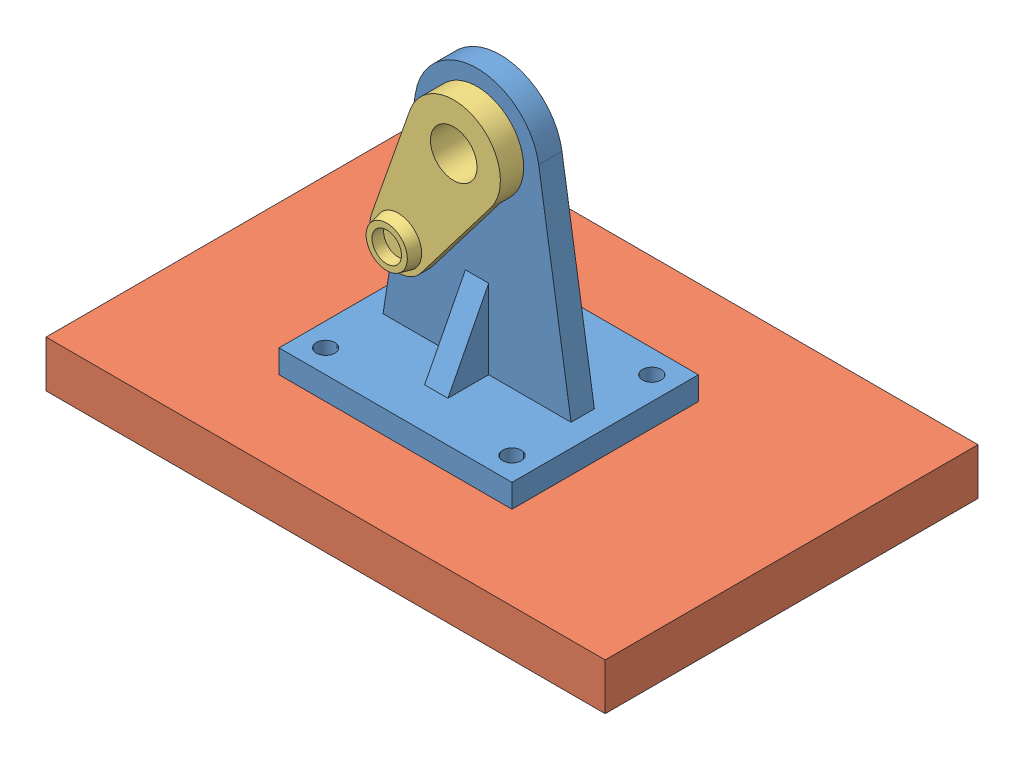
SolidWorks assembly Bill of Materials.SLDASM, configuration Default (file format 4628). Lengths in mm.
Overall size (152.4 90.01 101.6).
4 component instances, 3 part files, 2 mates.
Components (placement in the parent):
- Subassembly-1: Subassembly.sldasm [Default] at (-13.8841 20.0308 -6.2822) size (152.4 89.8 101.6)
  - Swing Bracket-1: Swing Bracket.SLDPRT [Default] at origin size (63.5 77.1 50.8)
  - Base Plate-1: Base Plate.SLDPRT [Default] at (-72.39 -12.7 -53.34) size (152.4 12.7 101.6)
- Swing Arm-1: Swing Arm.SLDPRT [Default] at (-13.8841 80.1325 -12.6322) x (0.879773 -0.475393 0) z (0 0 1) size (25.4 52.18 19.05)
Mates (geometry in assembly coordinates):
- Concentric4: concentric anti-aligned: cylinder of Subassembly-1/Swing Bracket-1 through (-13.8841 80.1325 -31.6822) axis (0 0 1) radius 7.9375; cylinder of Swing Arm-1 through (-13.8841 80.1325 -6.2822) axis (0 0 -1) radius 7.9375
- Coincident4: coincident anti-aligned: plane of Subassembly-1/Swing Bracket-1 through (-13.8841 80.1325 -6.2822) normal (0 0 1); plane of Swing Arm-1 through (-13.8841 80.1325 -6.2822) normal (0 0 -1)
